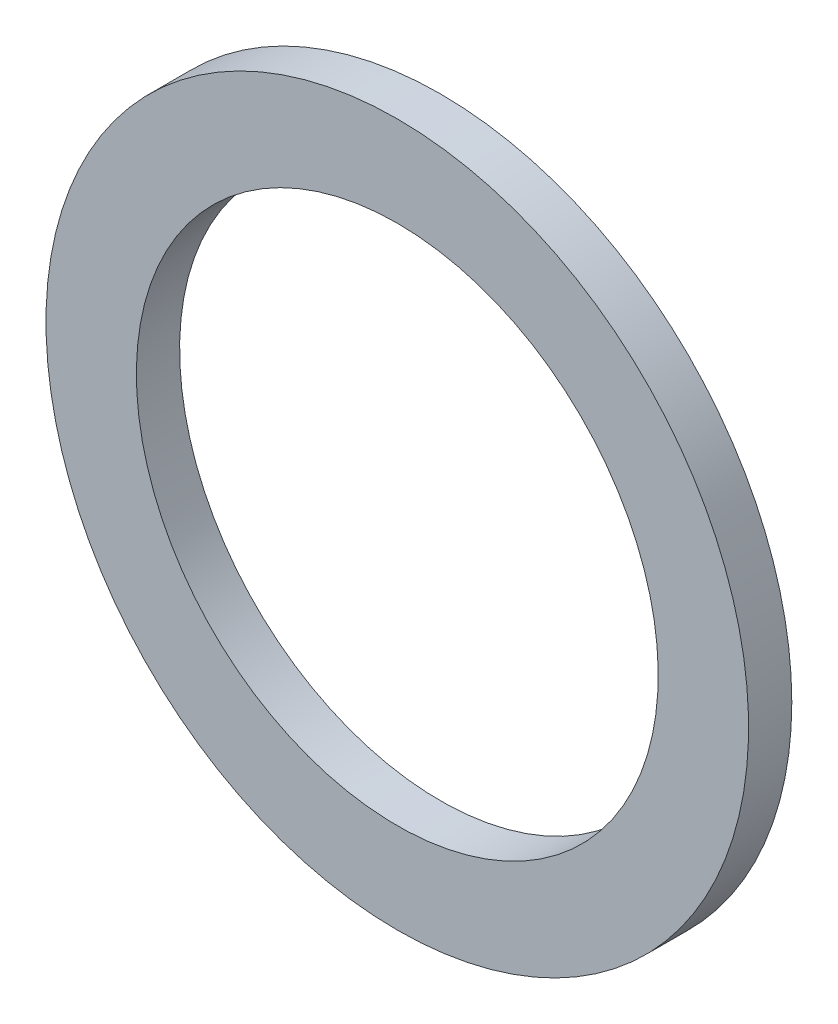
from build123d import *

# Parameters (mm, degrees)
ESQUISSE1_R        = 16.259373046
ESQUISSE1_R_2      = 12.076521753
BOSS_EXTRU_1_DEPTH = 2


with BuildPart() as part:
    # Esquisse1 → Boss.-Extru.1 (new body)
    with BuildSketch(Plane.XY):
        with Locations(Location((-0.530152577, 200.127831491, 0), (0, 0, 90))):
            Circle(ESQUISSE1_R)
        with Locations(Location((-0.530152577, 200.127831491, 0), (0, 0, 90))):
            Circle(ESQUISSE1_R_2, mode=Mode.SUBTRACT)
    extrude(amount=BOSS_EXTRU_1_DEPTH)


solid = part.part
